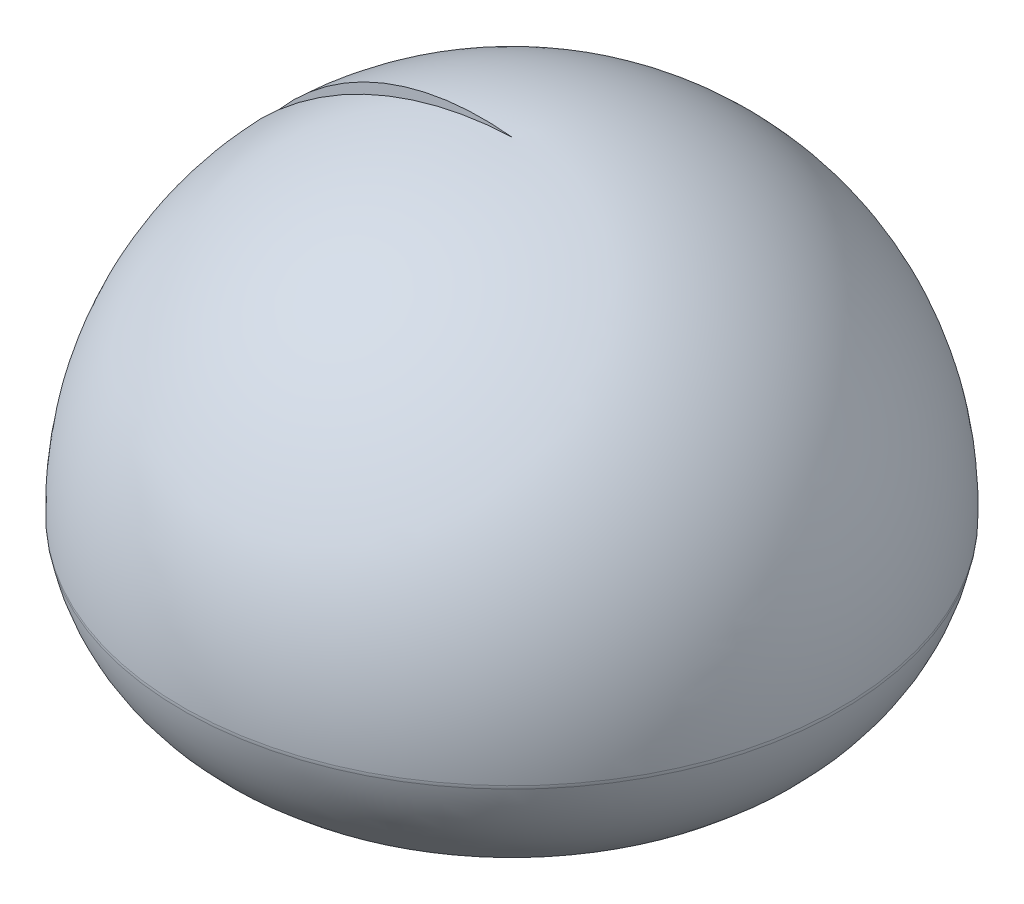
from build123d import *
from build123d.topology import SkipClean

# Parameters (mm, degrees)
ARBEITSRAUM_KUGEL_ANGLE           = 176
ARBEITSRAUM_KUGEL_OTHER_WAY_ANGLE = 176


with BuildPart() as part:
    # Aufsatz_rotiert → Arbeitsraum_Kugel (revolve)
    with BuildSketch(Plane.XY):
        with BuildLine():
            Line((0, 1176.878162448), (0, 1264.585992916))
            ThreePointArc((0, 1264.585992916), (646.452741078, 1008.022997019), (904.698241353, 362.240542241))
            ThreePointArc((904.698241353, 362.240542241), (904.392474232, 357.797193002), (903.707600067, 353.396307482))
            ThreePointArc((903.707600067, 353.396307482), (637.79858432, 10.588470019), (203.992031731, 16.645945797))
            ThreePointArc((203.992031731, 16.645945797), (175.889157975, 60.635461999), (200.139512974, 106.86066434))
            ThreePointArc((200.139512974, 106.86066434), (348.905560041, 329.00532324), (283.363821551, 588.203831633))
            ThreePointArc((283.363821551, 588.203831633), (282.215687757, 589.719576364), (281.123738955, 591.276284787))
            ThreePointArc((281.123738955, 591.276284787), (286.470704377, 954.122144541), (0, 1176.878162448))
        make_face()
    revolve(axis=Axis((0, 0, 0), (0, -1, 0)), revolution_arc=ARBEITSRAUM_KUGEL_ANGLE)

    # Aufsatz_rotiert → Arbeitsraum_Kugel other way (revolve)
    with SkipClean():  # the faces are left unmerged after this step: merging them gives an invalid solid
        with BuildSketch(Plane.XY):
            with BuildLine():
                Line((0, 1176.878162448), (0, 1264.585992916))
                ThreePointArc((0, 1264.585992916), (646.452741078, 1008.022997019), (904.698241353, 362.240542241))
                ThreePointArc((904.698241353, 362.240542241), (904.392474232, 357.797193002), (903.707600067, 353.396307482))
                ThreePointArc((903.707600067, 353.396307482), (637.79858432, 10.588470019), (203.992031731, 16.645945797))
                ThreePointArc((203.992031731, 16.645945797), (175.889157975, 60.635461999), (200.139512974, 106.86066434))
                ThreePointArc((200.139512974, 106.86066434), (348.905560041, 329.00532324), (283.363821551, 588.203831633))
                ThreePointArc((283.363821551, 588.203831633), (282.215687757, 589.719576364), (281.123738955, 591.276284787))
                ThreePointArc((281.123738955, 591.276284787), (286.470704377, 954.122144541), (0, 1176.878162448))
            make_face()
        revolve(axis=Axis((0, 0, 0), (0, 1, 0)), revolution_arc=ARBEITSRAUM_KUGEL_OTHER_WAY_ANGLE)


solid = part.part
